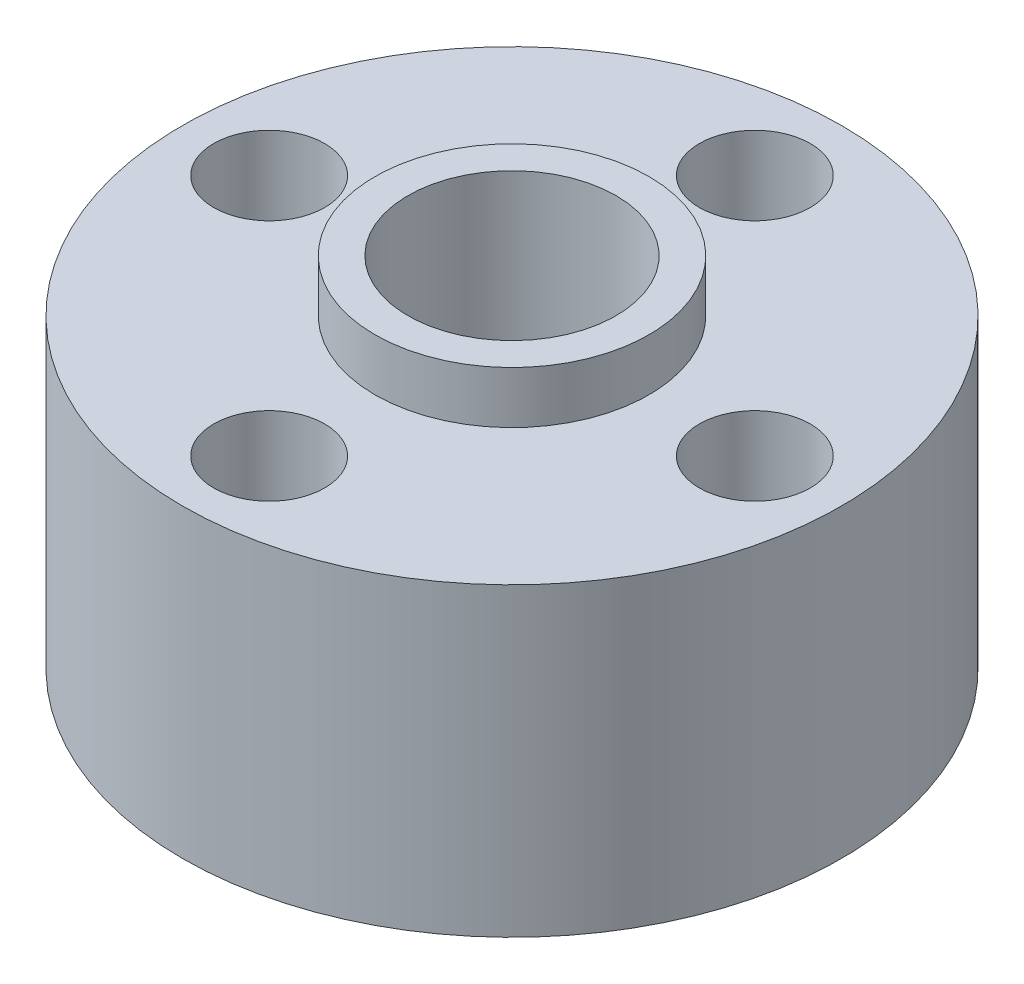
ISO-10303-21;
HEADER;
FILE_DESCRIPTION(('STEP AP214'),'2;1');
FILE_NAME('part.step','',(''),(''),'','','');
FILE_SCHEMA(('AUTOMOTIVE_DESIGN { 1 0 10303 214 1 1 1 1 }'));
ENDSEC;
DATA;
#1=APPLICATION_CONTEXT('core data for automotive mechanical design processes');
#2=APPLICATION_PROTOCOL_DEFINITION('international standard','automotive_design',2000,#1);
#3=PRODUCT_CONTEXT('',#1,'mechanical');
#4=PRODUCT('Part','Part','',(#3));
#5=PRODUCT_RELATED_PRODUCT_CATEGORY('part','',(#4));
#6=PRODUCT_DEFINITION_FORMATION('','',#4);
#7=PRODUCT_DEFINITION_CONTEXT('part definition',#1,'design');
#8=PRODUCT_DEFINITION('design','',#6,#7);
#9=PRODUCT_DEFINITION_SHAPE('','',#8);
#10=(LENGTH_UNIT() NAMED_UNIT(*) SI_UNIT(.MILLI.,.METRE.));
#11=(NAMED_UNIT(*) PLANE_ANGLE_UNIT() SI_UNIT($,.RADIAN.));
#12=(NAMED_UNIT(*) SI_UNIT($,.STERADIAN.) SOLID_ANGLE_UNIT());
#13=UNCERTAINTY_MEASURE_WITH_UNIT(LENGTH_MEASURE(1.E-05),#10,'distance_accuracy_value','');
#14=(GEOMETRIC_REPRESENTATION_CONTEXT(3) GLOBAL_UNCERTAINTY_ASSIGNED_CONTEXT((#13)) GLOBAL_UNIT_ASSIGNED_CONTEXT((#10,
#11,#12)) REPRESENTATION_CONTEXT('',''));
#15=CARTESIAN_POINT('',(0.,0.,0.));
#16=DIRECTION('',(0.,0.,1.));
#17=DIRECTION('',(1.,0.,0.));
#18=AXIS2_PLACEMENT_3D('',#15,#16,#17);
#19=CARTESIAN_POINT('',(9.5,-4.375,0.));
#20=DIRECTION('',(0.,-1.,0.));
#21=DIRECTION('',(0.,0.,-1.));
#22=AXIS2_PLACEMENT_3D('',#19,#20,#21);
#23=PLANE('',#22);
#24=CARTESIAN_POINT('',(0.,-4.375,-7.));
#25=DIRECTION('',(0.,-1.,0.));
#26=DIRECTION('',(0.,0.,-1.));
#27=AXIS2_PLACEMENT_3D('',#24,#25,#26);
#28=CIRCLE('',#27,1.59999999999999);
#29=CARTESIAN_POINT('',(0.,-4.375,-8.59999999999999));
#30=VERTEX_POINT('',#29);
#31=EDGE_CURVE('E137',#30,#30,#28,.T.);
#32=ORIENTED_EDGE('',*,*,#31,.F.);
#33=EDGE_LOOP('',(#32));
#34=FACE_BOUND('',#33,.T.);
#35=CARTESIAN_POINT('',(7.,-4.375,0.));
#36=DIRECTION('',(0.,-1.,0.));
#37=DIRECTION('',(0.,0.,-1.));
#38=AXIS2_PLACEMENT_3D('',#35,#36,#37);
#39=CIRCLE('',#38,1.59999999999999);
#40=CARTESIAN_POINT('',(7.,-4.375,-1.59999999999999));
#41=VERTEX_POINT('',#40);
#42=EDGE_CURVE('E63',#41,#41,#39,.T.);
#43=ORIENTED_EDGE('',*,*,#42,.F.);
#44=EDGE_LOOP('',(#43));
#45=FACE_BOUND('',#44,.T.);
#46=CARTESIAN_POINT('',(0.,-4.375,7.));
#47=DIRECTION('',(0.,-1.,0.));
#48=DIRECTION('',(0.,0.,-1.));
#49=AXIS2_PLACEMENT_3D('',#46,#47,#48);
#50=CIRCLE('',#49,1.59999999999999);
#51=CARTESIAN_POINT('',(0.,-4.375,5.40000000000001));
#52=VERTEX_POINT('',#51);
#53=EDGE_CURVE('E51',#52,#52,#50,.T.);
#54=ORIENTED_EDGE('',*,*,#53,.F.);
#55=EDGE_LOOP('',(#54));
#56=FACE_BOUND('',#55,.T.);
#57=CARTESIAN_POINT('',(-7.,-4.375,0.));
#58=DIRECTION('',(0.,-1.,0.));
#59=DIRECTION('',(0.,0.,-1.));
#60=AXIS2_PLACEMENT_3D('',#57,#58,#59);
#61=CIRCLE('',#60,1.59999999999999);
#62=CARTESIAN_POINT('',(-7.,-4.375,-1.59999999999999));
#63=VERTEX_POINT('',#62);
#64=EDGE_CURVE('E50',#63,#63,#61,.T.);
#65=ORIENTED_EDGE('',*,*,#64,.F.);
#66=EDGE_LOOP('',(#65));
#67=FACE_BOUND('',#66,.T.);
#68=CARTESIAN_POINT('',(0.,-4.375,0.));
#69=DIRECTION('',(0.,1.,0.));
#70=DIRECTION('',(0.,0.,1.));
#71=AXIS2_PLACEMENT_3D('',#68,#69,#70);
#72=CIRCLE('',#71,9.5);
#73=CARTESIAN_POINT('',(0.,-4.375,9.5));
#74=VERTEX_POINT('',#73);
#75=EDGE_CURVE('E10',#74,#74,#72,.T.);
#76=ORIENTED_EDGE('',*,*,#75,.F.);
#77=EDGE_LOOP('',(#76));
#78=FACE_BOUND('',#77,.T.);
#79=CARTESIAN_POINT('',(0.,-4.375,0.));
#80=DIRECTION('',(0.,-1.,0.));
#81=DIRECTION('',(0.,0.,-1.));
#82=AXIS2_PLACEMENT_3D('',#79,#80,#81);
#83=CIRCLE('',#82,3.95);
#84=CARTESIAN_POINT('',(0.,-4.375,-3.95));
#85=VERTEX_POINT('',#84);
#86=EDGE_CURVE('E69',#85,#85,#83,.T.);
#87=ORIENTED_EDGE('',*,*,#86,.F.);
#88=EDGE_LOOP('',(#87));
#89=FACE_BOUND('',#88,.T.);
#90=ADVANCED_FACE('F32',(#34,#45,#56,#67,#78,#89),#23,.T.);
#91=CARTESIAN_POINT('',(0.,4.425,0.));
#92=DIRECTION('',(0.,1.,0.));
#93=DIRECTION('',(0.,0.,1.));
#94=AXIS2_PLACEMENT_3D('',#91,#92,#93);
#95=PLANE('',#94);
#96=CARTESIAN_POINT('',(0.,4.425,-7.));
#97=DIRECTION('',(0.,1.,0.));
#98=DIRECTION('',(0.,0.,1.));
#99=AXIS2_PLACEMENT_3D('',#96,#97,#98);
#100=CIRCLE('',#99,1.59999999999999);
#101=CARTESIAN_POINT('',(0.,4.425,-5.40000000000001));
#102=VERTEX_POINT('',#101);
#103=EDGE_CURVE('E36',#102,#102,#100,.T.);
#104=ORIENTED_EDGE('',*,*,#103,.F.);
#105=EDGE_LOOP('',(#104));
#106=FACE_BOUND('',#105,.T.);
#107=CARTESIAN_POINT('',(7.,4.425,0.));
#108=DIRECTION('',(0.,1.,0.));
#109=DIRECTION('',(0.,0.,1.));
#110=AXIS2_PLACEMENT_3D('',#107,#108,#109);
#111=CIRCLE('',#110,1.59999999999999);
#112=CARTESIAN_POINT('',(7.,4.425,1.59999999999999));
#113=VERTEX_POINT('',#112);
#114=EDGE_CURVE('E58',#113,#113,#111,.T.);
#115=ORIENTED_EDGE('',*,*,#114,.F.);
#116=EDGE_LOOP('',(#115));
#117=FACE_BOUND('',#116,.T.);
#118=CARTESIAN_POINT('',(0.,4.425,7.));
#119=DIRECTION('',(0.,1.,0.));
#120=DIRECTION('',(0.,0.,1.));
#121=AXIS2_PLACEMENT_3D('',#118,#119,#120);
#122=CIRCLE('',#121,1.59999999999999);
#123=CARTESIAN_POINT('',(0.,4.425,8.59999999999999));
#124=VERTEX_POINT('',#123);
#125=EDGE_CURVE('E48',#124,#124,#122,.T.);
#126=ORIENTED_EDGE('',*,*,#125,.F.);
#127=EDGE_LOOP('',(#126));
#128=FACE_BOUND('',#127,.T.);
#129=CARTESIAN_POINT('',(-7.,4.425,0.));
#130=DIRECTION('',(0.,1.,0.));
#131=DIRECTION('',(0.,0.,1.));
#132=AXIS2_PLACEMENT_3D('',#129,#130,#131);
#133=CIRCLE('',#132,1.59999999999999);
#134=CARTESIAN_POINT('',(-7.,4.425,1.59999999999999));
#135=VERTEX_POINT('',#134);
#136=EDGE_CURVE('E55',#135,#135,#133,.T.);
#137=ORIENTED_EDGE('',*,*,#136,.F.);
#138=EDGE_LOOP('',(#137));
#139=FACE_BOUND('',#138,.T.);
#140=CARTESIAN_POINT('',(0.,4.425,0.));
#141=DIRECTION('',(0.,1.,0.));
#142=DIRECTION('',(0.,0.,1.));
#143=AXIS2_PLACEMENT_3D('',#140,#141,#142);
#144=CIRCLE('',#143,9.5);
#145=CARTESIAN_POINT('',(0.,4.425,9.5));
#146=VERTEX_POINT('',#145);
#147=EDGE_CURVE('E40',#146,#146,#144,.T.);
#148=ORIENTED_EDGE('',*,*,#147,.T.);
#149=EDGE_LOOP('',(#148));
#150=FACE_BOUND('',#149,.T.);
#151=CARTESIAN_POINT('',(0.,4.425,0.));
#152=DIRECTION('',(0.,1.,0.));
#153=DIRECTION('',(0.,0.,1.));
#154=AXIS2_PLACEMENT_3D('',#151,#152,#153);
#155=CIRCLE('',#154,3.95);
#156=CARTESIAN_POINT('',(0.,4.425,3.95));
#157=VERTEX_POINT('',#156);
#158=EDGE_CURVE('E73',#157,#157,#155,.T.);
#159=ORIENTED_EDGE('',*,*,#158,.F.);
#160=EDGE_LOOP('',(#159));
#161=FACE_BOUND('',#160,.T.);
#162=ADVANCED_FACE('F82',(#106,#117,#128,#139,#150,#161),#95,.T.);
#163=CARTESIAN_POINT('',(0.,-4.375,0.));
#164=DIRECTION('',(0.,1.,0.));
#165=DIRECTION('',(0.,0.,1.));
#166=AXIS2_PLACEMENT_3D('',#163,#164,#165);
#167=CYLINDRICAL_SURFACE('',#166,9.5);
#168=ORIENTED_EDGE('',*,*,#75,.T.);
#169=EDGE_LOOP('',(#168));
#170=FACE_BOUND('',#169,.T.);
#171=ORIENTED_EDGE('',*,*,#147,.F.);
#172=EDGE_LOOP('',(#171));
#173=FACE_BOUND('',#172,.T.);
#174=ADVANCED_FACE('F34',(#170,#173),#167,.T.);
#175=CARTESIAN_POINT('',(0.,5.925,0.));
#176=DIRECTION('',(0.,-1.,0.));
#177=DIRECTION('',(0.,0.,-1.));
#178=AXIS2_PLACEMENT_3D('',#175,#176,#177);
#179=CYLINDRICAL_SURFACE('',#178,3.95);
#180=CARTESIAN_POINT('',(0.,5.925,0.));
#181=DIRECTION('',(0.,1.,0.));
#182=DIRECTION('',(0.,0.,1.));
#183=AXIS2_PLACEMENT_3D('',#180,#181,#182);
#184=CIRCLE('',#183,3.95);
#185=CARTESIAN_POINT('',(0.,5.925,3.95));
#186=VERTEX_POINT('',#185);
#187=EDGE_CURVE('E45',#186,#186,#184,.T.);
#188=ORIENTED_EDGE('',*,*,#187,.F.);
#189=EDGE_LOOP('',(#188));
#190=FACE_BOUND('',#189,.T.);
#191=ORIENTED_EDGE('',*,*,#158,.T.);
#192=EDGE_LOOP('',(#191));
#193=FACE_BOUND('',#192,.T.);
#194=ADVANCED_FACE('F80',(#190,#193),#179,.T.);
#195=CARTESIAN_POINT('',(0.,5.925,0.));
#196=DIRECTION('',(0.,1.,0.));
#197=DIRECTION('',(0.,0.,1.));
#198=AXIS2_PLACEMENT_3D('',#195,#196,#197);
#199=PLANE('',#198);
#200=CARTESIAN_POINT('',(0.,5.925,0.));
#201=DIRECTION('',(0.,-1.,0.));
#202=DIRECTION('',(0.,0.,-1.));
#203=AXIS2_PLACEMENT_3D('',#200,#201,#202);
#204=CIRCLE('',#203,3.);
#205=CARTESIAN_POINT('',(0.,5.925,-3.));
#206=VERTEX_POINT('',#205);
#207=EDGE_CURVE('E132',#206,#206,#204,.T.);
#208=ORIENTED_EDGE('',*,*,#207,.T.);
#209=EDGE_LOOP('',(#208));
#210=FACE_BOUND('',#209,.T.);
#211=ORIENTED_EDGE('',*,*,#187,.T.);
#212=EDGE_LOOP('',(#211));
#213=FACE_BOUND('',#212,.T.);
#214=ADVANCED_FACE('F96',(#210,#213),#199,.T.);
#215=CARTESIAN_POINT('',(0.,-5.875,0.));
#216=DIRECTION('',(0.,1.,0.));
#217=DIRECTION('',(0.,0.,1.));
#218=AXIS2_PLACEMENT_3D('',#215,#216,#217);
#219=CYLINDRICAL_SURFACE('',#218,3.95);
#220=CARTESIAN_POINT('',(0.,-5.875,0.));
#221=DIRECTION('',(0.,-1.,0.));
#222=DIRECTION('',(0.,0.,-1.));
#223=AXIS2_PLACEMENT_3D('',#220,#221,#222);
#224=CIRCLE('',#223,3.95);
#225=CARTESIAN_POINT('',(0.,-5.875,-3.95));
#226=VERTEX_POINT('',#225);
#227=EDGE_CURVE('E70',#226,#226,#224,.T.);
#228=ORIENTED_EDGE('',*,*,#227,.F.);
#229=EDGE_LOOP('',(#228));
#230=FACE_BOUND('',#229,.T.);
#231=ORIENTED_EDGE('',*,*,#86,.T.);
#232=EDGE_LOOP('',(#231));
#233=FACE_BOUND('',#232,.T.);
#234=ADVANCED_FACE('F100',(#230,#233),#219,.T.);
#235=CARTESIAN_POINT('',(0.,-5.875,0.));
#236=DIRECTION('',(0.,-1.,0.));
#237=DIRECTION('',(0.,0.,-1.));
#238=AXIS2_PLACEMENT_3D('',#235,#236,#237);
#239=PLANE('',#238);
#240=CARTESIAN_POINT('',(0.,-5.875,0.));
#241=DIRECTION('',(0.,-1.,0.));
#242=DIRECTION('',(0.,0.,-1.));
#243=AXIS2_PLACEMENT_3D('',#240,#241,#242);
#244=CIRCLE('',#243,2.99999999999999);
#245=CARTESIAN_POINT('',(0.,-5.875,-2.99999999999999));
#246=VERTEX_POINT('',#245);
#247=EDGE_CURVE('E135',#246,#246,#244,.T.);
#248=ORIENTED_EDGE('',*,*,#247,.F.);
#249=EDGE_LOOP('',(#248));
#250=FACE_BOUND('',#249,.T.);
#251=ORIENTED_EDGE('',*,*,#227,.T.);
#252=EDGE_LOOP('',(#251));
#253=FACE_BOUND('',#252,.T.);
#254=ADVANCED_FACE('F104',(#250,#253),#239,.T.);
#255=CARTESIAN_POINT('',(-7.,-4.375,0.));
#256=DIRECTION('',(0.,-1.,0.));
#257=DIRECTION('',(0.,0.,-1.));
#258=AXIS2_PLACEMENT_3D('',#255,#256,#257);
#259=CYLINDRICAL_SURFACE('',#258,1.59999999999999);
#260=ORIENTED_EDGE('',*,*,#136,.T.);
#261=EDGE_LOOP('',(#260));
#262=FACE_BOUND('',#261,.T.);
#263=ORIENTED_EDGE('',*,*,#64,.T.);
#264=EDGE_LOOP('',(#263));
#265=FACE_BOUND('',#264,.T.);
#266=ADVANCED_FACE('F108',(#262,#265),#259,.F.);
#267=CARTESIAN_POINT('',(0.,-4.375,7.));
#268=DIRECTION('',(0.,-1.,0.));
#269=DIRECTION('',(0.,0.,-1.));
#270=AXIS2_PLACEMENT_3D('',#267,#268,#269);
#271=CYLINDRICAL_SURFACE('',#270,1.59999999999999);
#272=ORIENTED_EDGE('',*,*,#125,.T.);
#273=EDGE_LOOP('',(#272));
#274=FACE_BOUND('',#273,.T.);
#275=ORIENTED_EDGE('',*,*,#53,.T.);
#276=EDGE_LOOP('',(#275));
#277=FACE_BOUND('',#276,.T.);
#278=ADVANCED_FACE('F112',(#274,#277),#271,.F.);
#279=CARTESIAN_POINT('',(7.,-4.375,0.));
#280=DIRECTION('',(0.,-1.,0.));
#281=DIRECTION('',(0.,0.,-1.));
#282=AXIS2_PLACEMENT_3D('',#279,#280,#281);
#283=CYLINDRICAL_SURFACE('',#282,1.59999999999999);
#284=ORIENTED_EDGE('',*,*,#114,.T.);
#285=EDGE_LOOP('',(#284));
#286=FACE_BOUND('',#285,.T.);
#287=ORIENTED_EDGE('',*,*,#42,.T.);
#288=EDGE_LOOP('',(#287));
#289=FACE_BOUND('',#288,.T.);
#290=ADVANCED_FACE('F116',(#286,#289),#283,.F.);
#291=CARTESIAN_POINT('',(0.,-4.375,-7.));
#292=DIRECTION('',(0.,-1.,0.));
#293=DIRECTION('',(0.,0.,-1.));
#294=AXIS2_PLACEMENT_3D('',#291,#292,#293);
#295=CYLINDRICAL_SURFACE('',#294,1.59999999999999);
#296=ORIENTED_EDGE('',*,*,#103,.T.);
#297=EDGE_LOOP('',(#296));
#298=FACE_BOUND('',#297,.T.);
#299=ORIENTED_EDGE('',*,*,#31,.T.);
#300=EDGE_LOOP('',(#299));
#301=FACE_BOUND('',#300,.T.);
#302=ADVANCED_FACE('F119',(#298,#301),#295,.F.);
#303=CARTESIAN_POINT('',(0.,-5.875,0.));
#304=DIRECTION('',(0.,-1.,0.));
#305=DIRECTION('',(0.,0.,-1.));
#306=AXIS2_PLACEMENT_3D('',#303,#304,#305);
#307=CYLINDRICAL_SURFACE('',#306,2.99999999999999);
#308=ORIENTED_EDGE('',*,*,#207,.F.);
#309=EDGE_LOOP('',(#308));
#310=FACE_BOUND('',#309,.T.);
#311=ORIENTED_EDGE('',*,*,#247,.T.);
#312=EDGE_LOOP('',(#311));
#313=FACE_BOUND('',#312,.T.);
#314=ADVANCED_FACE('F123',(#310,#313),#307,.F.);
#315=CLOSED_SHELL('',(#90,#162,#174,#194,#214,#234,#254,#266,#278,#290,#302,#314));
#316=MANIFOLD_SOLID_BREP('B2',#315);
#317=ADVANCED_BREP_SHAPE_REPRESENTATION('',(#18,#316),#14);
#318=SHAPE_DEFINITION_REPRESENTATION(#9,#317);
ENDSEC;
END-ISO-10303-21;
